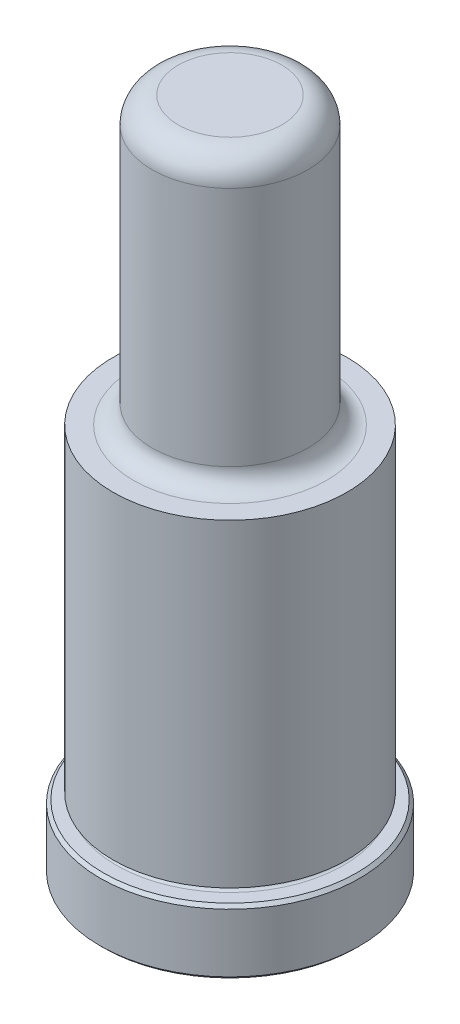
ISO-10303-21;
HEADER;
FILE_DESCRIPTION(('STEP AP214'),'2;1');
FILE_NAME('part.step','',(''),(''),'','','');
FILE_SCHEMA(('AUTOMOTIVE_DESIGN { 1 0 10303 214 1 1 1 1 }'));
ENDSEC;
DATA;
#1=APPLICATION_CONTEXT('core data for automotive mechanical design processes');
#2=APPLICATION_PROTOCOL_DEFINITION('international standard','automotive_design',2000,#1);
#3=PRODUCT_CONTEXT('',#1,'mechanical');
#4=PRODUCT('Part','Part','',(#3));
#5=PRODUCT_RELATED_PRODUCT_CATEGORY('part','',(#4));
#6=PRODUCT_DEFINITION_FORMATION('','',#4);
#7=PRODUCT_DEFINITION_CONTEXT('part definition',#1,'design');
#8=PRODUCT_DEFINITION('design','',#6,#7);
#9=PRODUCT_DEFINITION_SHAPE('','',#8);
#10=(LENGTH_UNIT() NAMED_UNIT(*) SI_UNIT(.MILLI.,.METRE.));
#11=(NAMED_UNIT(*) PLANE_ANGLE_UNIT() SI_UNIT($,.RADIAN.));
#12=(NAMED_UNIT(*) SI_UNIT($,.STERADIAN.) SOLID_ANGLE_UNIT());
#13=UNCERTAINTY_MEASURE_WITH_UNIT(LENGTH_MEASURE(1.E-05),#10,'distance_accuracy_value','');
#14=(GEOMETRIC_REPRESENTATION_CONTEXT(3) GLOBAL_UNCERTAINTY_ASSIGNED_CONTEXT((#13)) GLOBAL_UNIT_ASSIGNED_CONTEXT((#10,
#11,#12)) REPRESENTATION_CONTEXT('',''));
#15=CARTESIAN_POINT('',(0.,0.,0.));
#16=DIRECTION('',(0.,0.,1.));
#17=DIRECTION('',(1.,0.,0.));
#18=AXIS2_PLACEMENT_3D('',#15,#16,#17);
#19=CARTESIAN_POINT('',(0.,0.,0.));
#20=DIRECTION('',(0.,1.,0.));
#21=DIRECTION('',(0.,0.,1.));
#22=AXIS2_PLACEMENT_3D('',#19,#20,#21);
#23=PLANE('',#22);
#24=CARTESIAN_POINT('',(0.,0.,0.));
#25=DIRECTION('',(0.,1.,0.));
#26=DIRECTION('',(0.,0.,1.));
#27=AXIS2_PLACEMENT_3D('',#24,#25,#26);
#28=CIRCLE('',#27,15.494);
#29=CARTESIAN_POINT('',(0.,0.,15.494));
#30=VERTEX_POINT('',#29);
#31=EDGE_CURVE('E46',#30,#30,#28,.F.);
#32=ORIENTED_EDGE('',*,*,#31,.T.);
#33=EDGE_LOOP('',(#32));
#34=FACE_BOUND('',#33,.T.);
#35=ADVANCED_FACE('F31',(#34),#23,.F.);
#36=CARTESIAN_POINT('',(0.,0.,0.));
#37=DIRECTION('',(0.,1.,0.));
#38=DIRECTION('',(0.,0.,1.));
#39=AXIS2_PLACEMENT_3D('',#36,#37,#38);
#40=CYLINDRICAL_SURFACE('',#39,15.875);
#41=CARTESIAN_POINT('',(0.,0.380999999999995,0.));
#42=DIRECTION('',(0.,1.,0.));
#43=DIRECTION('',(0.,0.,1.));
#44=AXIS2_PLACEMENT_3D('',#41,#42,#43);
#45=CIRCLE('',#44,15.875);
#46=CARTESIAN_POINT('',(0.,0.380999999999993,15.875));
#47=VERTEX_POINT('',#46);
#48=EDGE_CURVE('E51',#47,#47,#45,.T.);
#49=ORIENTED_EDGE('',*,*,#48,.T.);
#50=EDGE_LOOP('',(#49));
#51=FACE_BOUND('',#50,.T.);
#52=CARTESIAN_POINT('',(0.,7.5438,0.));
#53=DIRECTION('',(0.,-1.,0.));
#54=DIRECTION('',(0.,0.,-1.));
#55=AXIS2_PLACEMENT_3D('',#52,#53,#54);
#56=CIRCLE('',#55,15.875);
#57=CARTESIAN_POINT('',(0.,7.5438,-15.875));
#58=VERTEX_POINT('',#57);
#59=EDGE_CURVE('E54',#58,#58,#56,.T.);
#60=ORIENTED_EDGE('',*,*,#59,.T.);
#61=EDGE_LOOP('',(#60));
#62=FACE_BOUND('',#61,.T.);
#63=ADVANCED_FACE('F110',(#51,#62),#40,.T.);
#64=CARTESIAN_POINT('',(0.,7.9248,-15.875));
#65=DIRECTION('',(0.,-1.,0.));
#66=DIRECTION('',(0.,0.,-1.));
#67=AXIS2_PLACEMENT_3D('',#64,#65,#66);
#68=PLANE('',#67);
#69=CARTESIAN_POINT('',(0.,7.9248,0.));
#70=DIRECTION('',(0.,-1.,0.));
#71=DIRECTION('',(0.,0.,-1.));
#72=AXIS2_PLACEMENT_3D('',#69,#70,#71);
#73=CIRCLE('',#72,15.494);
#74=CARTESIAN_POINT('',(0.,7.9248,-15.494));
#75=VERTEX_POINT('',#74);
#76=EDGE_CURVE('E42',#75,#75,#73,.F.);
#77=ORIENTED_EDGE('',*,*,#76,.T.);
#78=EDGE_LOOP('',(#77));
#79=FACE_BOUND('',#78,.T.);
#80=CARTESIAN_POINT('',(0.,7.9248,0.));
#81=DIRECTION('',(0.,1.,0.));
#82=DIRECTION('',(0.,0.,1.));
#83=AXIS2_PLACEMENT_3D('',#80,#81,#82);
#84=CIRCLE('',#83,13.8938);
#85=CARTESIAN_POINT('',(0.,7.9248,13.8938));
#86=VERTEX_POINT('',#85);
#87=EDGE_CURVE('E57',#86,#86,#84,.T.);
#88=ORIENTED_EDGE('',*,*,#87,.F.);
#89=EDGE_LOOP('',(#88));
#90=FACE_BOUND('',#89,.T.);
#91=ADVANCED_FACE('F105',(#79,#90),#68,.F.);
#92=CARTESIAN_POINT('',(0.,8.3058,0.));
#93=DIRECTION('',(0.,1.,0.));
#94=DIRECTION('',(0.,0.,1.));
#95=AXIS2_PLACEMENT_3D('',#92,#93,#94);
#96=TOROIDAL_SURFACE('',#95,13.8938,0.381000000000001);
#97=CARTESIAN_POINT('',(0.,8.68680000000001,0.));
#98=DIRECTION('',(0.,1.,0.));
#99=DIRECTION('',(0.,0.,1.));
#100=AXIS2_PLACEMENT_3D('',#97,#98,#99);
#101=CIRCLE('',#100,13.8938);
#102=CARTESIAN_POINT('',(0.,8.6868,13.8938));
#103=VERTEX_POINT('',#102);
#104=EDGE_CURVE('E60',#103,#103,#101,.T.);
#105=ORIENTED_EDGE('',*,*,#104,.F.);
#106=EDGE_LOOP('',(#105));
#107=FACE_BOUND('',#106,.T.);
#108=ORIENTED_EDGE('',*,*,#87,.T.);
#109=EDGE_LOOP('',(#108));
#110=FACE_BOUND('',#109,.T.);
#111=ADVANCED_FACE('F99',(#107,#110),#96,.F.);
#112=CARTESIAN_POINT('',(0.,8.68680000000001,-13.8938));
#113=DIRECTION('',(0.,1.,0.));
#114=DIRECTION('',(0.,0.,1.));
#115=AXIS2_PLACEMENT_3D('',#112,#113,#114);
#116=PLANE('',#115);
#117=CARTESIAN_POINT('',(0.,8.6868,0.));
#118=DIRECTION('',(0.,1.,0.));
#119=DIRECTION('',(0.,0.,1.));
#120=AXIS2_PLACEMENT_3D('',#117,#118,#119);
#121=CIRCLE('',#120,14.3002);
#122=CARTESIAN_POINT('',(0.,8.6868,14.3002));
#123=VERTEX_POINT('',#122);
#124=EDGE_CURVE('E63',#123,#123,#121,.T.);
#125=ORIENTED_EDGE('',*,*,#124,.F.);
#126=EDGE_LOOP('',(#125));
#127=FACE_BOUND('',#126,.T.);
#128=ORIENTED_EDGE('',*,*,#104,.T.);
#129=EDGE_LOOP('',(#128));
#130=FACE_BOUND('',#129,.T.);
#131=ADVANCED_FACE('F93',(#127,#130),#116,.F.);
#132=CARTESIAN_POINT('',(0.,0.,0.));
#133=DIRECTION('',(0.,1.,0.));
#134=DIRECTION('',(0.,0.,1.));
#135=AXIS2_PLACEMENT_3D('',#132,#133,#134);
#136=CYLINDRICAL_SURFACE('',#135,14.3002);
#137=CARTESIAN_POINT('',(0.,47.625,0.));
#138=DIRECTION('',(0.,1.,0.));
#139=DIRECTION('',(0.,0.,1.));
#140=AXIS2_PLACEMENT_3D('',#137,#138,#139);
#141=CIRCLE('',#140,14.3002);
#142=CARTESIAN_POINT('',(0.,47.625,14.3002));
#143=VERTEX_POINT('',#142);
#144=EDGE_CURVE('E66',#143,#143,#141,.T.);
#145=ORIENTED_EDGE('',*,*,#144,.F.);
#146=EDGE_LOOP('',(#145));
#147=FACE_BOUND('',#146,.T.);
#148=ORIENTED_EDGE('',*,*,#124,.T.);
#149=EDGE_LOOP('',(#148));
#150=FACE_BOUND('',#149,.T.);
#151=ADVANCED_FACE('F87',(#147,#150),#136,.T.);
#152=CARTESIAN_POINT('',(0.,47.625,-14.3002));
#153=DIRECTION('',(0.,-1.,0.));
#154=DIRECTION('',(0.,0.,-1.));
#155=AXIS2_PLACEMENT_3D('',#152,#153,#154);
#156=PLANE('',#155);
#157=CARTESIAN_POINT('',(0.,47.625,0.));
#158=DIRECTION('',(0.,1.,0.));
#159=DIRECTION('',(0.,0.,1.));
#160=AXIS2_PLACEMENT_3D('',#157,#158,#159);
#161=CIRCLE('',#160,11.7983);
#162=CARTESIAN_POINT('',(0.,47.625,11.7983));
#163=VERTEX_POINT('',#162);
#164=EDGE_CURVE('E69',#163,#163,#161,.T.);
#165=ORIENTED_EDGE('',*,*,#164,.F.);
#166=EDGE_LOOP('',(#165));
#167=FACE_BOUND('',#166,.T.);
#168=ORIENTED_EDGE('',*,*,#144,.T.);
#169=EDGE_LOOP('',(#168));
#170=FACE_BOUND('',#169,.T.);
#171=ADVANCED_FACE('F81',(#167,#170),#156,.F.);
#172=CARTESIAN_POINT('',(0.,49.911,0.));
#173=DIRECTION('',(0.,1.,0.));
#174=DIRECTION('',(0.,0.,1.));
#175=AXIS2_PLACEMENT_3D('',#172,#173,#174);
#176=TOROIDAL_SURFACE('',#175,11.7983,2.286);
#177=CARTESIAN_POINT('',(0.,49.911,0.));
#178=DIRECTION('',(0.,1.,0.));
#179=DIRECTION('',(0.,0.,1.));
#180=AXIS2_PLACEMENT_3D('',#177,#178,#179);
#181=CIRCLE('',#180,9.5123);
#182=CARTESIAN_POINT('',(0.,49.911,9.5123));
#183=VERTEX_POINT('',#182);
#184=EDGE_CURVE('E72',#183,#183,#181,.T.);
#185=ORIENTED_EDGE('',*,*,#184,.F.);
#186=EDGE_LOOP('',(#185));
#187=FACE_BOUND('',#186,.T.);
#188=ORIENTED_EDGE('',*,*,#164,.T.);
#189=EDGE_LOOP('',(#188));
#190=FACE_BOUND('',#189,.T.);
#191=ADVANCED_FACE('F78',(#187,#190),#176,.F.);
#192=CARTESIAN_POINT('',(0.,0.,0.));
#193=DIRECTION('',(0.,1.,0.));
#194=DIRECTION('',(0.,0.,1.));
#195=AXIS2_PLACEMENT_3D('',#192,#193,#194);
#196=CYLINDRICAL_SURFACE('',#195,9.5123);
#197=CARTESIAN_POINT('',(0.,79.375,0.));
#198=DIRECTION('',(0.,-1.,0.));
#199=DIRECTION('',(0.,0.,-1.));
#200=AXIS2_PLACEMENT_3D('',#197,#198,#199);
#201=CIRCLE('',#200,9.5123);
#202=CARTESIAN_POINT('',(0.,79.375,-9.51229999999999));
#203=VERTEX_POINT('',#202);
#204=EDGE_CURVE('E10',#203,#203,#201,.T.);
#205=ORIENTED_EDGE('',*,*,#204,.T.);
#206=EDGE_LOOP('',(#205));
#207=FACE_BOUND('',#206,.T.);
#208=ORIENTED_EDGE('',*,*,#184,.T.);
#209=EDGE_LOOP('',(#208));
#210=FACE_BOUND('',#209,.T.);
#211=ADVANCED_FACE('F76',(#207,#210),#196,.T.);
#212=CARTESIAN_POINT('',(0.,82.55,-9.51229999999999));
#213=DIRECTION('',(0.,-1.,0.));
#214=DIRECTION('',(0.,0.,-1.));
#215=AXIS2_PLACEMENT_3D('',#212,#213,#214);
#216=PLANE('',#215);
#217=CARTESIAN_POINT('',(0.,82.55,0.));
#218=DIRECTION('',(0.,-1.,0.));
#219=DIRECTION('',(0.,0.,-1.));
#220=AXIS2_PLACEMENT_3D('',#217,#218,#219);
#221=CIRCLE('',#220,6.3373);
#222=CARTESIAN_POINT('',(0.,82.55,-6.33729999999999));
#223=VERTEX_POINT('',#222);
#224=EDGE_CURVE('E38',#223,#223,#221,.F.);
#225=ORIENTED_EDGE('',*,*,#224,.T.);
#226=EDGE_LOOP('',(#225));
#227=FACE_BOUND('',#226,.T.);
#228=ADVANCED_FACE('F127',(#227),#216,.F.);
#229=CARTESIAN_POINT('',(0.,0.380999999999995,0.));
#230=DIRECTION('',(0.,1.,0.));
#231=DIRECTION('',(0.,0.,1.));
#232=AXIS2_PLACEMENT_3D('',#229,#230,#231);
#233=CONICAL_SURFACE('',#232,15.875,0.785398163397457);
#234=ORIENTED_EDGE('',*,*,#31,.F.);
#235=EDGE_LOOP('',(#234));
#236=FACE_BOUND('',#235,.T.);
#237=ORIENTED_EDGE('',*,*,#48,.F.);
#238=EDGE_LOOP('',(#237));
#239=FACE_BOUND('',#238,.T.);
#240=ADVANCED_FACE('F124',(#236,#239),#233,.T.);
#241=CARTESIAN_POINT('',(0.,7.9248,0.));
#242=DIRECTION('',(0.,-1.,0.));
#243=DIRECTION('',(0.,0.,-1.));
#244=AXIS2_PLACEMENT_3D('',#241,#242,#243);
#245=CONICAL_SURFACE('',#244,15.494,0.78539816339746);
#246=ORIENTED_EDGE('',*,*,#59,.F.);
#247=EDGE_LOOP('',(#246));
#248=FACE_BOUND('',#247,.T.);
#249=ORIENTED_EDGE('',*,*,#76,.F.);
#250=EDGE_LOOP('',(#249));
#251=FACE_BOUND('',#250,.T.);
#252=ADVANCED_FACE('F126',(#248,#251),#245,.T.);
#253=CARTESIAN_POINT('',(0.,79.375,0.));
#254=DIRECTION('',(0.,-1.,0.));
#255=DIRECTION('',(0.,0.,-1.));
#256=AXIS2_PLACEMENT_3D('',#253,#254,#255);
#257=TOROIDAL_SURFACE('',#256,6.3373,3.175);
#258=ORIENTED_EDGE('',*,*,#204,.F.);
#259=EDGE_LOOP('',(#258));
#260=FACE_BOUND('',#259,.T.);
#261=ORIENTED_EDGE('',*,*,#224,.F.);
#262=EDGE_LOOP('',(#261));
#263=FACE_BOUND('',#262,.T.);
#264=ADVANCED_FACE('F33',(#260,#263),#257,.T.);
#265=CLOSED_SHELL('',(#35,#63,#91,#111,#131,#151,#171,#191,#211,#228,#240,#252,#264));
#266=MANIFOLD_SOLID_BREP('B2',#265);
#267=ADVANCED_BREP_SHAPE_REPRESENTATION('',(#18,#266),#14);
#268=SHAPE_DEFINITION_REPRESENTATION(#9,#267);
ENDSEC;
END-ISO-10303-21;
